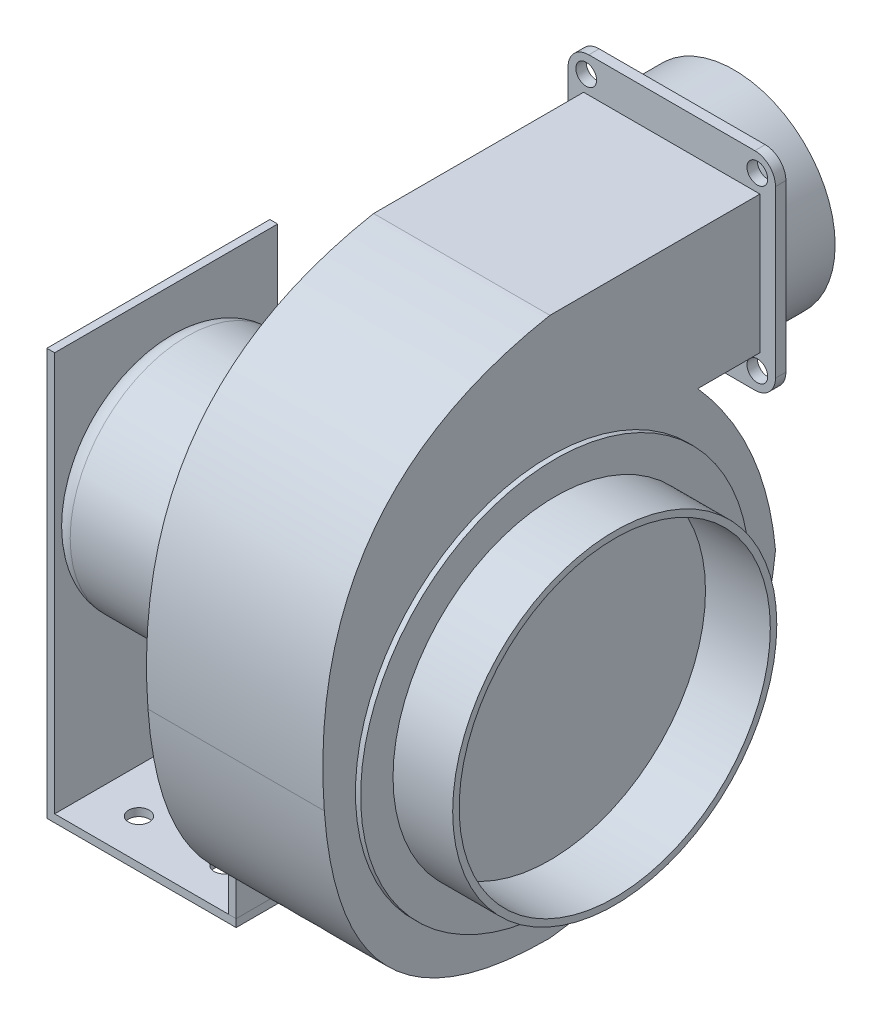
from build123d import *

# Parameters (mm, degrees)
EXTRUDE_1_DEPTH     = 68
EXTRUDE_2_DEPTH     = 4
SKETCH_3_R          = 4
CUT_EXTRUDE_1_DEPTH = 5
SKETCH_4_W          = 52
SKETCH_4_H          = 52
CUT_EXTRUDE_2_DEPTH = 80
SKETCH_6_R          = 39
SKETCH_6_R_2        = 37
EXTRUDE_3_DEPTH     = 20
SKETCH_7_R          = 62.5
SKETCH_7_R_2        = 60
EXTRUDE_4_DEPTH     = 25
SKETCH_8_R          = 75
SKETCH_8_R_2        = 62.5
EXTRUDE_5_DEPTH     = 2
SKETCH_9_R          = 45
EXTRUDE_6_DEPTH     = 80
FILLET_1_R          = 8
SKETCH_10_W         = 86
SKETCH_10_H         = 157
EXTRUDE_7_DEPTH     = 3
SKETCH_11_W         = 86
SKETCH_11_H         = 3
EXTRUDE_8_DEPTH     = 70
SKETCH_12_W         = 3
SKETCH_12_H         = 86
EXTRUDE_10_DEPTH    = 52
SKETCH_13_R         = 4
CUT_EXTRUDE_3_DEPTH = 3


with BuildPart() as part:
    # Sketch 1 → Extrude 1 (new body)
    with BuildSketch(Plane(origin=(0, 0, 0), x_dir=(0, 0, -1), z_dir=(1, 0, 0))):
        with BuildLine():
            Line((0, 122), (81, 122))
            Line((81, 122), (81, 69))
            Line((81, 69), (57, 69))
            add(Edge.make_bspline(
                [(57, 69), (83.39752811, 39.149218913), (87, 0)],
                knots=[0, 0, 0, 1, 1, 1], degree=2))
            add(Edge.make_bspline(
                [(87, 0), (78.215790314, -76.749685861), (0, -86)],
                knots=[0, 0, 0, 1, 1, 1], degree=2))
            add(Edge.make_bspline(
                [(-87, 0), (-80.720911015, -86.260993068), (0, -86)],
                knots=[0, 0, 0, 1, 1, 1], degree=2))
            add(Edge.make_bspline(
                [(-87, 0), (-94.615583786, 104.377264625), (0, 122)],
                knots=[0, 0, 0, 1, 1, 1], degree=2))
        make_face()
    extrude(amount=EXTRUDE_1_DEPTH)

    # Sketch 2 → Extrude 2 (add)
    with BuildSketch(Plane(origin=(0, 0, -81), x_dir=(-1, 0, 0), z_dir=(0, 0, -1))):
        with BuildLine():
            Line((-66, 55.5), (-2, 55.5))
            ThreePointArc((-2, 55.5), (3.656854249, 57.843145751), (6, 63.5))
            Line((6, 63.5), (6, 127.5))
            ThreePointArc((6, 127.5), (3.656854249, 133.156854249), (-2, 135.5))
            Line((-2, 135.5), (-66, 135.5))
            ThreePointArc((-66, 135.5), (-71.656854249, 133.156854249), (-74, 127.5))
            Line((-74, 127.5), (-74, 63.5))
            ThreePointArc((-74, 63.5), (-71.656854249, 57.843145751), (-66, 55.5))
        make_face()
    extrude(amount=EXTRUDE_2_DEPTH)

    # Sketch 3 → Cut-Extrude 1 (cut)
    with BuildSketch(Plane(origin=(0, 0, -85), x_dir=(-1, 0, 0), z_dir=(0, 0, -1))):
        with Locations((-67, 128.5)):
            Circle(SKETCH_3_R)
        with Locations((-1, 128.5)):
            Circle(SKETCH_3_R)
        with Locations((-1, 62.5)):
            Circle(SKETCH_3_R)
        with Locations((-67, 62.5)):
            Circle(SKETCH_3_R)
    extrude(amount=-CUT_EXTRUDE_1_DEPTH, mode=Mode.SUBTRACT)

    # Sketch 4 → Cut-Extrude 2 (cut)
    with BuildSketch(Plane(origin=(0, 0, -85), x_dir=(-1, 0, 0), z_dir=(0, 0, -1))):
        with Locations((-34, 95.5)):
            Rectangle(SKETCH_4_W, SKETCH_4_H)
    extrude(amount=-CUT_EXTRUDE_2_DEPTH, mode=Mode.SUBTRACT)

    # Sketch 6 → Extrude 3 (add)
    with BuildSketch(Plane(origin=(0, 0, -85), x_dir=(-1, 0, 0), z_dir=(0, 0, -1))):
        with Locations(Location((-34, 95.5, 0), (0, 0, 180))):
            Circle(SKETCH_6_R)
        with Locations((-34, 95.5)):
            Circle(SKETCH_6_R_2, mode=Mode.SUBTRACT)
    extrude(amount=EXTRUDE_3_DEPTH)

    # Sketch 7 → Extrude 4 (add)
    with BuildSketch(Plane(origin=(68, 0, 0), x_dir=(0, 0, -1), z_dir=(1, 0, 0))):
        Circle(SKETCH_7_R)
        Circle(SKETCH_7_R_2, mode=Mode.SUBTRACT)
    extrude(amount=EXTRUDE_4_DEPTH)

    # Sketch 8 → Extrude 5 (add)
    with BuildSketch(Plane(origin=(68, 0, 0), x_dir=(0, 0, -1), z_dir=(1, 0, 0))):
        Circle(SKETCH_8_R)
        Circle(SKETCH_8_R_2, mode=Mode.SUBTRACT)
    extrude(amount=EXTRUDE_5_DEPTH)

    # Sketch 9 → Extrude 6 (add)
    with BuildSketch(Plane.ZY):
        with Locations(Location((0, 0, 0), (0, 0, 180))):
            Circle(SKETCH_9_R)
    extrude(amount=EXTRUDE_6_DEPTH)

    # Fillet 1
    fillet_1_edges = [part.edges().sort_by_distance(p)[0] for p in [
        (-80, 0, 45),
    ]]
    fillet(fillet_1_edges, radius=FILLET_1_R)

    # Sketch 10 → Extrude 7 (add)
    with BuildSketch(Plane.ZY.offset(80)):
        with Locations((0, -21.5)):
            Rectangle(SKETCH_10_W, SKETCH_10_H)
    extrude(amount=EXTRUDE_7_DEPTH)

    # Sketch 11 → Extrude 8 (add)
    with BuildSketch(Plane(origin=(-80, 0, 0), x_dir=(0, 0, -1), z_dir=(1, 0, 0))):
        with Locations((0, -98.5)):
            Rectangle(SKETCH_11_W, SKETCH_11_H)
    extrude(amount=EXTRUDE_8_DEPTH)

    # Sketch 13 → Cut-Extrude 3 (cut)
    with BuildSketch(Plane.XZ.offset(100)):
        with Locations(Location((-63, 27.5, 0), (0, 0, 270))):
            Circle(SKETCH_13_R)
        with Locations(Location((-30, 27.5, 0), (0, 0, 270))):
            Circle(SKETCH_13_R)
        with Locations(Location((-30, -27.5, 0), (0, 0, 270))):
            Circle(SKETCH_13_R)
        with Locations(Location((-63, -27.5, 0), (0, 0, 270))):
            Circle(SKETCH_13_R)
    extrude(amount=-CUT_EXTRUDE_3_DEPTH, mode=Mode.SUBTRACT)


with BuildPart() as body_2:
    # Sketch 12 → Extrude 10 (new body)
    with BuildSketch(Plane(origin=(0, -97, 0), x_dir=(1, 0, 0), z_dir=(0, 1, 0))):
        with Locations((-11.5, 0)):
            Rectangle(SKETCH_12_W, SKETCH_12_H)
    extrude(amount=EXTRUDE_10_DEPTH)


solid = Compound([part.part, body_2.part])
